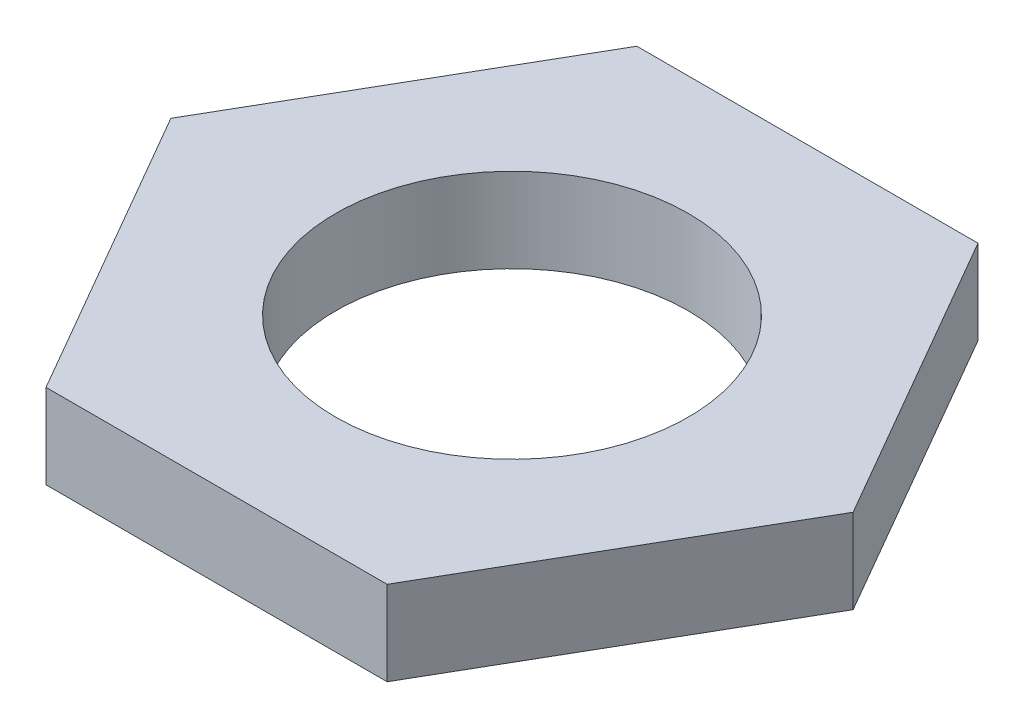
from build123d import *

# Parameters (mm, degrees)
SKETCH1_R           = 1.59258
BOSS_EXTRUDE1_DEPTH = 0.762


with BuildPart() as part:
    # Sketch1 → Boss-Extrude1 (new body)
    with BuildSketch(Plane(origin=(0, 0, 0), x_dir=(1, 0, 0), z_dir=(0, 1, 0))):
        Polygon((3.079586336, 0), (1.539793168, 2.667), (-1.539793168, 2.667), (-3.079586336, 0), (-1.539793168, -2.667), (1.539793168, -2.667), align=None)
        with Locations(Location((0, 0, 0), (0, 0, 90))):
            Circle(SKETCH1_R, mode=Mode.SUBTRACT)
    extrude(amount=BOSS_EXTRUDE1_DEPTH)


solid = part.part
